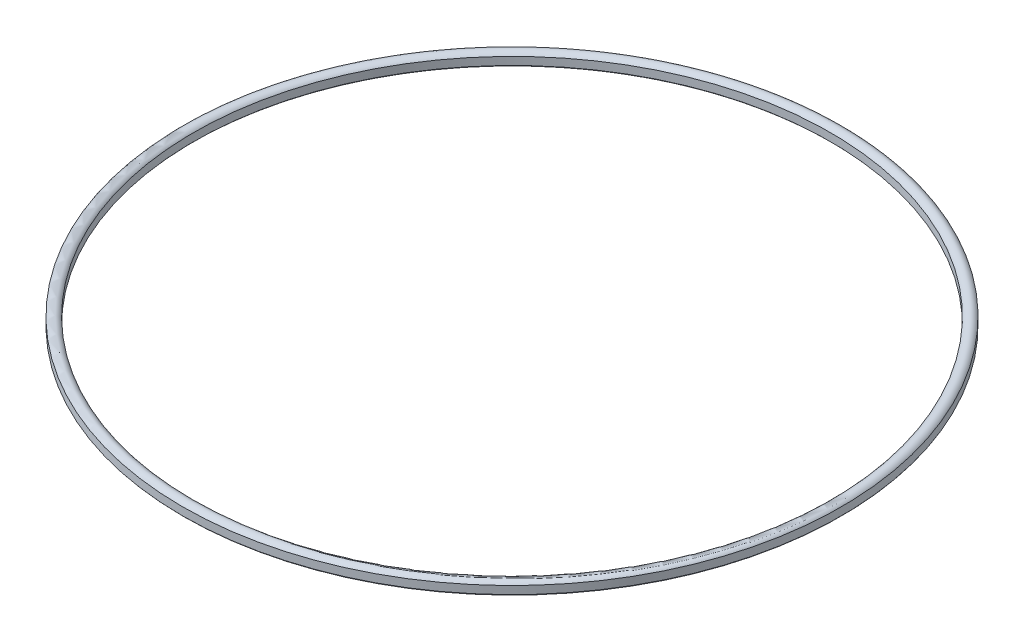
ISO-10303-21;
HEADER;
FILE_DESCRIPTION(('STEP AP214'),'2;1');
FILE_NAME('part.step','',(''),(''),'','','');
FILE_SCHEMA(('AUTOMOTIVE_DESIGN { 1 0 10303 214 1 1 1 1 }'));
ENDSEC;
DATA;
#1=APPLICATION_CONTEXT('core data for automotive mechanical design processes');
#2=APPLICATION_PROTOCOL_DEFINITION('international standard','automotive_design',2000,#1);
#3=PRODUCT_CONTEXT('',#1,'mechanical');
#4=PRODUCT('Part','Part','',(#3));
#5=PRODUCT_RELATED_PRODUCT_CATEGORY('part','',(#4));
#6=PRODUCT_DEFINITION_FORMATION('','',#4);
#7=PRODUCT_DEFINITION_CONTEXT('part definition',#1,'design');
#8=PRODUCT_DEFINITION('design','',#6,#7);
#9=PRODUCT_DEFINITION_SHAPE('','',#8);
#10=(LENGTH_UNIT() NAMED_UNIT(*) SI_UNIT(.MILLI.,.METRE.));
#11=(NAMED_UNIT(*) PLANE_ANGLE_UNIT() SI_UNIT($,.RADIAN.));
#12=(NAMED_UNIT(*) SI_UNIT($,.STERADIAN.) SOLID_ANGLE_UNIT());
#13=UNCERTAINTY_MEASURE_WITH_UNIT(LENGTH_MEASURE(1.E-05),#10,'distance_accuracy_value','');
#14=(GEOMETRIC_REPRESENTATION_CONTEXT(3) GLOBAL_UNCERTAINTY_ASSIGNED_CONTEXT((#13)) GLOBAL_UNIT_ASSIGNED_CONTEXT((#10,
#11,#12)) REPRESENTATION_CONTEXT('',''));
#15=CARTESIAN_POINT('',(0.,0.,0.));
#16=DIRECTION('',(0.,0.,1.));
#17=DIRECTION('',(1.,0.,0.));
#18=AXIS2_PLACEMENT_3D('',#15,#16,#17);
#19=CARTESIAN_POINT('',(0.,0.,0.));
#20=DIRECTION('',(0.,1.,0.));
#21=DIRECTION('',(0.,0.,1.));
#22=AXIS2_PLACEMENT_3D('',#19,#20,#21);
#23=TOROIDAL_SURFACE('',#22,127.3937,2.667);
#24=CARTESIAN_POINT('',(0.,-1.54809822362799,0.));
#25=DIRECTION('',(0.,1.,0.));
#26=DIRECTION('',(0.,0.,1.));
#27=AXIS2_PLACEMENT_3D('',#24,#25,#26);
#28=CIRCLE('',#27,125.222);
#29=CARTESIAN_POINT('',(0.,-1.54809822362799,125.222));
#30=VERTEX_POINT('',#29);
#31=EDGE_CURVE('E10',#30,#30,#28,.T.);
#32=ORIENTED_EDGE('',*,*,#31,.T.);
#33=EDGE_LOOP('',(#32));
#34=FACE_BOUND('',#33,.T.);
#35=CARTESIAN_POINT('',(0.,-1.54809822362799,0.));
#36=DIRECTION('',(0.,1.,0.));
#37=DIRECTION('',(0.,0.,1.));
#38=AXIS2_PLACEMENT_3D('',#35,#36,#37);
#39=CIRCLE('',#38,129.5654);
#40=CARTESIAN_POINT('',(0.,-1.54809822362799,129.5654));
#41=VERTEX_POINT('',#40);
#42=EDGE_CURVE('E44',#41,#41,#39,.T.);
#43=ORIENTED_EDGE('',*,*,#42,.F.);
#44=EDGE_LOOP('',(#43));
#45=FACE_BOUND('',#44,.T.);
#46=ADVANCED_FACE('F30',(#34,#45),#23,.T.);
#47=CARTESIAN_POINT('',(0.,25.6201168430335,0.));
#48=DIRECTION('',(0.,1.,0.));
#49=DIRECTION('',(0.,0.,1.));
#50=AXIS2_PLACEMENT_3D('',#47,#48,#49);
#51=CYLINDRICAL_SURFACE('',#50,125.222);
#52=CARTESIAN_POINT('',(0.,1.54809822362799,0.));
#53=DIRECTION('',(0.,1.,0.));
#54=DIRECTION('',(0.,0.,1.));
#55=AXIS2_PLACEMENT_3D('',#52,#53,#54);
#56=CIRCLE('',#55,125.222);
#57=CARTESIAN_POINT('',(0.,1.54809822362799,125.222));
#58=VERTEX_POINT('',#57);
#59=EDGE_CURVE('E36',#58,#58,#56,.T.);
#60=ORIENTED_EDGE('',*,*,#59,.T.);
#61=EDGE_LOOP('',(#60));
#62=FACE_BOUND('',#61,.T.);
#63=ORIENTED_EDGE('',*,*,#31,.F.);
#64=EDGE_LOOP('',(#63));
#65=FACE_BOUND('',#64,.T.);
#66=ADVANCED_FACE('F54',(#62,#65),#51,.F.);
#67=CARTESIAN_POINT('',(0.,0.,0.));
#68=DIRECTION('',(0.,1.,0.));
#69=DIRECTION('',(0.,0.,1.));
#70=AXIS2_PLACEMENT_3D('',#67,#68,#69);
#71=TOROIDAL_SURFACE('',#70,127.3937,2.667);
#72=CARTESIAN_POINT('',(0.,1.54809822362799,0.));
#73=DIRECTION('',(0.,1.,0.));
#74=DIRECTION('',(0.,0.,1.));
#75=AXIS2_PLACEMENT_3D('',#72,#73,#74);
#76=CIRCLE('',#75,129.5654);
#77=CARTESIAN_POINT('',(0.,1.54809822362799,129.5654));
#78=VERTEX_POINT('',#77);
#79=EDGE_CURVE('E40',#78,#78,#76,.T.);
#80=ORIENTED_EDGE('',*,*,#79,.T.);
#81=EDGE_LOOP('',(#80));
#82=FACE_BOUND('',#81,.T.);
#83=ORIENTED_EDGE('',*,*,#59,.F.);
#84=EDGE_LOOP('',(#83));
#85=FACE_BOUND('',#84,.T.);
#86=ADVANCED_FACE('F58',(#82,#85),#71,.T.);
#87=CARTESIAN_POINT('',(0.,25.6201168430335,0.));
#88=DIRECTION('',(0.,1.,0.));
#89=DIRECTION('',(0.,0.,1.));
#90=AXIS2_PLACEMENT_3D('',#87,#88,#89);
#91=CYLINDRICAL_SURFACE('',#90,129.5654);
#92=ORIENTED_EDGE('',*,*,#42,.T.);
#93=EDGE_LOOP('',(#92));
#94=FACE_BOUND('',#93,.T.);
#95=ORIENTED_EDGE('',*,*,#79,.F.);
#96=EDGE_LOOP('',(#95));
#97=FACE_BOUND('',#96,.T.);
#98=ADVANCED_FACE('F50',(#94,#97),#91,.T.);
#99=CLOSED_SHELL('',(#46,#66,#86,#98));
#100=MANIFOLD_SOLID_BREP('B2',#99);
#101=ADVANCED_BREP_SHAPE_REPRESENTATION('',(#18,#100),#14);
#102=SHAPE_DEFINITION_REPRESENTATION(#9,#101);
ENDSEC;
END-ISO-10303-21;
